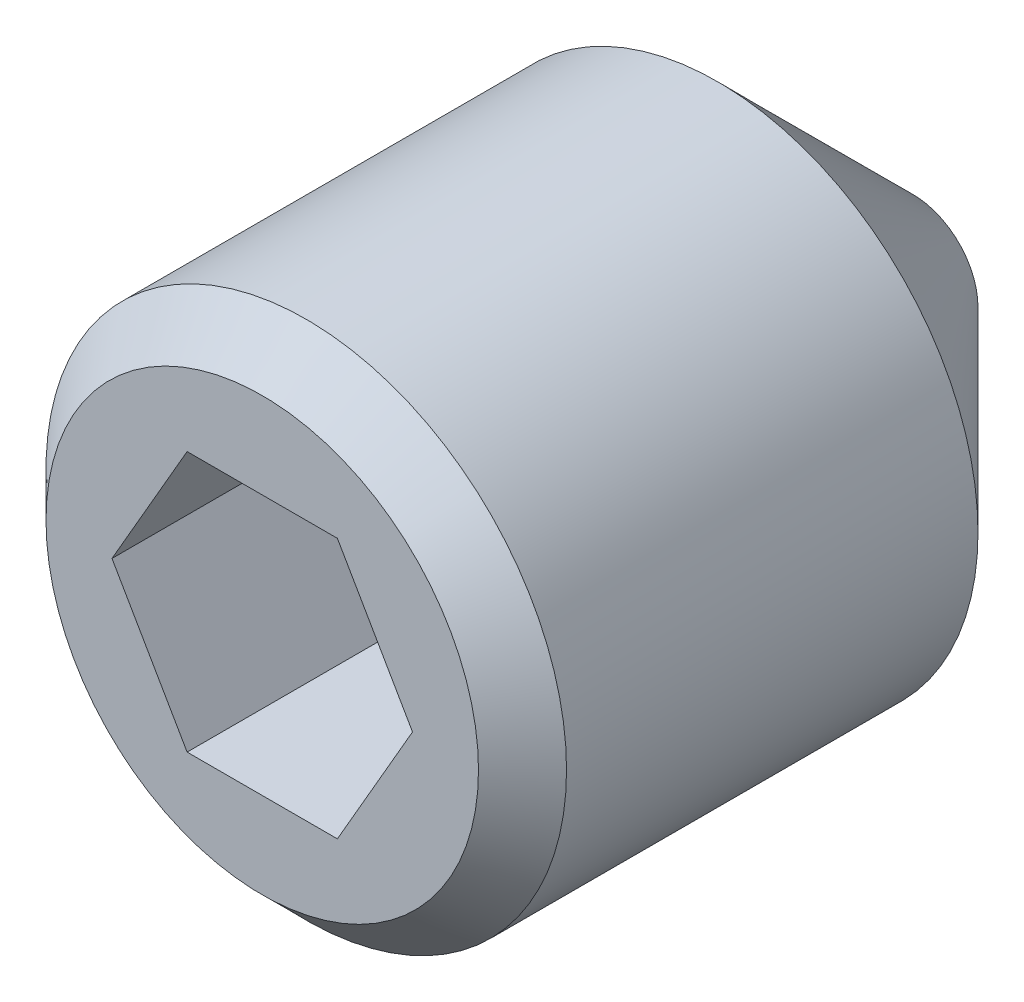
ISO-10303-21;
HEADER;
FILE_DESCRIPTION(('STEP AP214'),'2;1');
FILE_NAME('part.step','',(''),(''),'','','');
FILE_SCHEMA(('AUTOMOTIVE_DESIGN { 1 0 10303 214 1 1 1 1 }'));
ENDSEC;
DATA;
#1=APPLICATION_CONTEXT('core data for automotive mechanical design processes');
#2=APPLICATION_PROTOCOL_DEFINITION('international standard','automotive_design',2000,#1);
#3=PRODUCT_CONTEXT('',#1,'mechanical');
#4=PRODUCT('Part','Part','',(#3));
#5=PRODUCT_RELATED_PRODUCT_CATEGORY('part','',(#4));
#6=PRODUCT_DEFINITION_FORMATION('','',#4);
#7=PRODUCT_DEFINITION_CONTEXT('part definition',#1,'design');
#8=PRODUCT_DEFINITION('design','',#6,#7);
#9=PRODUCT_DEFINITION_SHAPE('','',#8);
#10=(LENGTH_UNIT() NAMED_UNIT(*) SI_UNIT(.MILLI.,.METRE.));
#11=(NAMED_UNIT(*) PLANE_ANGLE_UNIT() SI_UNIT($,.RADIAN.));
#12=(NAMED_UNIT(*) SI_UNIT($,.STERADIAN.) SOLID_ANGLE_UNIT());
#13=UNCERTAINTY_MEASURE_WITH_UNIT(LENGTH_MEASURE(1.E-05),#10,'distance_accuracy_value','');
#14=(GEOMETRIC_REPRESENTATION_CONTEXT(3) GLOBAL_UNCERTAINTY_ASSIGNED_CONTEXT((#13)) GLOBAL_UNIT_ASSIGNED_CONTEXT((#10,
#11,#12)) REPRESENTATION_CONTEXT('',''));
#15=CARTESIAN_POINT('',(0.,0.,0.));
#16=DIRECTION('',(0.,0.,1.));
#17=DIRECTION('',(1.,0.,0.));
#18=AXIS2_PLACEMENT_3D('',#15,#16,#17);
#19=CARTESIAN_POINT('',(0.,3.3234375,0.));
#20=DIRECTION('',(0.,0.,-1.));
#21=DIRECTION('',(-1.,0.,0.));
#22=AXIS2_PLACEMENT_3D('',#19,#20,#21);
#23=PLANE('',#22);
#24=CARTESIAN_POINT('',(0.,0.,0.));
#25=DIRECTION('',(0.,0.,1.));
#26=DIRECTION('',(1.,0.,0.));
#27=AXIS2_PLACEMENT_3D('',#24,#25,#26);
#28=CIRCLE('',#27,3.3234375);
#29=CARTESIAN_POINT('',(3.3234375,0.,0.));
#30=VERTEX_POINT('',#29);
#31=EDGE_CURVE('E106',#30,#30,#28,.T.);
#32=ORIENTED_EDGE('',*,*,#31,.T.);
#33=EDGE_LOOP('',(#32));
#34=FACE_BOUND('',#33,.T.);
#35=DIRECTION('',(0.5,-0.866025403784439,0.));
#36=VECTOR('',#35,1.);
#37=CARTESIAN_POINT('',(1.1547,1.99999906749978,0.));
#38=LINE('',#37,#36);
#39=CARTESIAN_POINT('',(1.1547,1.99999906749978,0.));
#40=VERTEX_POINT('',#39);
#41=CARTESIAN_POINT('',(2.3094,0.,0.));
#42=VERTEX_POINT('',#41);
#43=EDGE_CURVE('E30',#40,#42,#38,.T.);
#44=ORIENTED_EDGE('',*,*,#43,.T.);
#45=DIRECTION('',(-0.5,-0.866025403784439,0.));
#46=VECTOR('',#45,1.);
#47=CARTESIAN_POINT('',(2.3094,0.,0.));
#48=LINE('',#47,#46);
#49=CARTESIAN_POINT('',(1.1547,-1.99999906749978,0.));
#50=VERTEX_POINT('',#49);
#51=EDGE_CURVE('E154',#42,#50,#48,.T.);
#52=ORIENTED_EDGE('',*,*,#51,.T.);
#53=DIRECTION('',(-1.,0.,0.));
#54=VECTOR('',#53,1.);
#55=CARTESIAN_POINT('',(1.1547,-1.99999906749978,0.));
#56=LINE('',#55,#54);
#57=CARTESIAN_POINT('',(-1.1547,-1.99999906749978,0.));
#58=VERTEX_POINT('',#57);
#59=EDGE_CURVE('E209',#50,#58,#56,.T.);
#60=ORIENTED_EDGE('',*,*,#59,.T.);
#61=DIRECTION('',(-0.5,0.866025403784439,0.));
#62=VECTOR('',#61,1.);
#63=CARTESIAN_POINT('',(-1.1547,-1.99999906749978,0.));
#64=LINE('',#63,#62);
#65=CARTESIAN_POINT('',(-2.3094,0.,0.));
#66=VERTEX_POINT('',#65);
#67=EDGE_CURVE('E207',#58,#66,#64,.T.);
#68=ORIENTED_EDGE('',*,*,#67,.T.);
#69=DIRECTION('',(0.5,0.866025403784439,0.));
#70=VECTOR('',#69,1.);
#71=CARTESIAN_POINT('',(-2.3094,0.,0.));
#72=LINE('',#71,#70);
#73=CARTESIAN_POINT('',(-1.1547,1.99999906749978,0.));
#74=VERTEX_POINT('',#73);
#75=EDGE_CURVE('E95',#66,#74,#72,.T.);
#76=ORIENTED_EDGE('',*,*,#75,.T.);
#77=DIRECTION('',(1.,0.,0.));
#78=VECTOR('',#77,1.);
#79=CARTESIAN_POINT('',(-1.1547,1.99999906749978,0.));
#80=LINE('',#79,#78);
#81=EDGE_CURVE('E91',#74,#40,#80,.T.);
#82=ORIENTED_EDGE('',*,*,#81,.T.);
#83=EDGE_LOOP('',(#44,#52,#60,#68,#76,#82));
#84=FACE_BOUND('',#83,.T.);
#85=ADVANCED_FACE('F16',(#34,#84),#23,.F.);
#86=CARTESIAN_POINT('',(0.,0.,-10.));
#87=DIRECTION('',(0.,0.,1.));
#88=DIRECTION('',(1.,0.,0.));
#89=AXIS2_PLACEMENT_3D('',#86,#87,#88);
#90=PLANE('',#89);
#91=CARTESIAN_POINT('',(0.,0.,-10.));
#92=DIRECTION('',(0.,0.,1.));
#93=DIRECTION('',(1.,0.,0.));
#94=AXIS2_PLACEMENT_3D('',#91,#92,#93);
#95=CIRCLE('',#94,1.);
#96=CARTESIAN_POINT('',(1.,0.,-10.));
#97=VERTEX_POINT('',#96);
#98=EDGE_CURVE('E11',#97,#97,#95,.T.);
#99=ORIENTED_EDGE('',*,*,#98,.F.);
#100=EDGE_LOOP('',(#99));
#101=FACE_BOUND('',#100,.T.);
#102=ADVANCED_FACE('F119',(#101),#90,.F.);
#103=CARTESIAN_POINT('',(0.,0.,-10.));
#104=DIRECTION('',(0.,0.,1.));
#105=DIRECTION('',(1.,0.,0.));
#106=AXIS2_PLACEMENT_3D('',#103,#104,#105);
#107=CONICAL_SURFACE('',#106,1.,0.785398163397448);
#108=CARTESIAN_POINT('',(0.,0.,-7.));
#109=DIRECTION('',(0.,0.,1.));
#110=DIRECTION('',(1.,0.,0.));
#111=AXIS2_PLACEMENT_3D('',#108,#109,#110);
#112=CIRCLE('',#111,4.);
#113=CARTESIAN_POINT('',(4.,0.,-7.));
#114=VERTEX_POINT('',#113);
#115=EDGE_CURVE('E23',#114,#114,#112,.T.);
#116=CARTESIAN_POINT('',(4.,0.,-7.));
#117=CARTESIAN_POINT('',(3.96875,0.,-7.03125));
#118=CARTESIAN_POINT('',(3.9375,0.,-7.0625));
#119=CARTESIAN_POINT('',(3.875,0.,-7.125));
#120=CARTESIAN_POINT('',(3.84375,0.,-7.15625));
#121=CARTESIAN_POINT('',(3.78125,0.,-7.21875));
#122=CARTESIAN_POINT('',(3.75,0.,-7.25));
#123=CARTESIAN_POINT('',(3.6875,0.,-7.3125));
#124=CARTESIAN_POINT('',(3.65625,0.,-7.34375));
#125=CARTESIAN_POINT('',(3.59375,0.,-7.40625));
#126=CARTESIAN_POINT('',(3.5625,0.,-7.4375));
#127=CARTESIAN_POINT('',(3.5,0.,-7.5));
#128=CARTESIAN_POINT('',(3.46875,0.,-7.53125));
#129=CARTESIAN_POINT('',(3.40625,0.,-7.59375));
#130=CARTESIAN_POINT('',(3.375,0.,-7.625));
#131=CARTESIAN_POINT('',(3.3125,0.,-7.6875));
#132=CARTESIAN_POINT('',(3.28125,0.,-7.71875));
#133=CARTESIAN_POINT('',(3.21875,0.,-7.78125));
#134=CARTESIAN_POINT('',(3.1875,0.,-7.8125));
#135=CARTESIAN_POINT('',(3.125,0.,-7.875));
#136=CARTESIAN_POINT('',(3.09375,0.,-7.90625));
#137=CARTESIAN_POINT('',(3.03125,0.,-7.96875));
#138=CARTESIAN_POINT('',(3.,0.,-8.));
#139=CARTESIAN_POINT('',(2.9375,0.,-8.0625));
#140=CARTESIAN_POINT('',(2.90625,0.,-8.09375));
#141=CARTESIAN_POINT('',(2.84375,0.,-8.15625));
#142=CARTESIAN_POINT('',(2.8125,0.,-8.1875));
#143=CARTESIAN_POINT('',(2.75,0.,-8.25));
#144=CARTESIAN_POINT('',(2.71875,0.,-8.28125));
#145=CARTESIAN_POINT('',(2.65625,0.,-8.34375));
#146=CARTESIAN_POINT('',(2.625,0.,-8.375));
#147=CARTESIAN_POINT('',(2.5625,0.,-8.4375));
#148=CARTESIAN_POINT('',(2.53125,0.,-8.46875));
#149=CARTESIAN_POINT('',(2.46875,0.,-8.53125));
#150=CARTESIAN_POINT('',(2.4375,0.,-8.5625));
#151=CARTESIAN_POINT('',(2.375,0.,-8.625));
#152=CARTESIAN_POINT('',(2.34375,0.,-8.65625));
#153=CARTESIAN_POINT('',(2.28125,0.,-8.71875));
#154=CARTESIAN_POINT('',(2.25,0.,-8.75));
#155=CARTESIAN_POINT('',(2.1875,0.,-8.8125));
#156=CARTESIAN_POINT('',(2.15625,0.,-8.84375));
#157=CARTESIAN_POINT('',(2.09375,0.,-8.90625));
#158=CARTESIAN_POINT('',(2.0625,0.,-8.9375));
#159=CARTESIAN_POINT('',(2.,0.,-9.));
#160=CARTESIAN_POINT('',(1.96875,0.,-9.03125));
#161=CARTESIAN_POINT('',(1.90625,0.,-9.09375));
#162=CARTESIAN_POINT('',(1.875,0.,-9.125));
#163=CARTESIAN_POINT('',(1.8125,0.,-9.1875));
#164=CARTESIAN_POINT('',(1.78125,0.,-9.21875));
#165=CARTESIAN_POINT('',(1.71875,0.,-9.28125));
#166=CARTESIAN_POINT('',(1.6875,0.,-9.3125));
#167=CARTESIAN_POINT('',(1.625,0.,-9.375));
#168=CARTESIAN_POINT('',(1.59375,0.,-9.40625));
#169=CARTESIAN_POINT('',(1.53125,0.,-9.46875));
#170=CARTESIAN_POINT('',(1.5,0.,-9.5));
#171=CARTESIAN_POINT('',(1.4375,0.,-9.5625));
#172=CARTESIAN_POINT('',(1.40625,0.,-9.59375));
#173=CARTESIAN_POINT('',(1.34375,0.,-9.65625));
#174=CARTESIAN_POINT('',(1.3125,0.,-9.6875));
#175=CARTESIAN_POINT('',(1.25,0.,-9.75));
#176=CARTESIAN_POINT('',(1.21875,0.,-9.78125));
#177=CARTESIAN_POINT('',(1.15625,0.,-9.84375));
#178=CARTESIAN_POINT('',(1.125,0.,-9.875));
#179=CARTESIAN_POINT('',(1.0625,0.,-9.9375));
#180=CARTESIAN_POINT('',(1.03125,0.,-9.96875));
#181=CARTESIAN_POINT('',(1.,0.,-10.));
#182=B_SPLINE_CURVE_WITH_KNOTS('',3,(#116,#117,#118,#119,#120,#121,#122,#123,#124,#125,#126,
#127,#128,#129,#130,#131,#132,#133,#134,#135,#136,#137,#138,#139,#140,#141,#142,#143,#144,#145,
#146,#147,#148,#149,#150,#151,#152,#153,#154,#155,#156,#157,#158,#159,#160,#161,#162,#163,#164,
#165,#166,#167,#168,#169,#170,#171,#172,#173,#174,#175,#176,#177,#178,#179,#180,#181),
.UNSPECIFIED.,.F.,.F.,(4,2,2,2,2,2,2,2,2,2,2,2,2,2,2,2,2,2,2,2,2,2,2,2,2,2,2,2,2,2,2,2,4),(0.,
0.132582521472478,0.265165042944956,0.397747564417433,0.53033008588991,0.662912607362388,
0.795495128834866,0.928077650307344,1.06066017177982,1.1932426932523,1.32582521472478,
1.45840773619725,1.59099025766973,1.72357277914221,1.85615530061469,1.98873782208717,
2.12132034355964,2.25390286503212,2.3864853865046,2.51906790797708,2.65165042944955,
2.78423295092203,2.91681547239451,3.04939799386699,3.18198051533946,3.31456303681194,
3.44714555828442,3.5797280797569,3.71231060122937,3.84489312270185,3.97747564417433,
4.11005816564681,4.24264068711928),.UNSPECIFIED.);
#183=EDGE_CURVE('BSEAM116',#114,#97,#182,.T.);
#184=ORIENTED_EDGE('',*,*,#115,.F.);
#185=ORIENTED_EDGE('',*,*,#98,.T.);
#186=ORIENTED_EDGE('',*,*,#183,.T.);
#187=ORIENTED_EDGE('',*,*,#183,.F.);
#188=EDGE_LOOP('',(#184,#186,#185,#187));
#189=FACE_BOUND('',#188,.T.);
#190=ADVANCED_FACE('F116',(#189),#107,.T.);
#191=CARTESIAN_POINT('',(0.,0.,0.));
#192=DIRECTION('',(0.,0.,1.));
#193=DIRECTION('',(1.,0.,0.));
#194=AXIS2_PLACEMENT_3D('',#191,#192,#193);
#195=CYLINDRICAL_SURFACE('',#194,4.);
#196=CARTESIAN_POINT('',(0.,0.,-0.6765625));
#197=DIRECTION('',(0.,0.,1.));
#198=DIRECTION('',(1.,0.,0.));
#199=AXIS2_PLACEMENT_3D('',#196,#197,#198);
#200=CIRCLE('',#199,4.);
#201=CARTESIAN_POINT('',(4.,0.,-0.6765625));
#202=VERTEX_POINT('',#201);
#203=EDGE_CURVE('E109',#202,#202,#200,.T.);
#204=ORIENTED_EDGE('',*,*,#203,.F.);
#205=EDGE_LOOP('',(#204));
#206=FACE_BOUND('',#205,.T.);
#207=ORIENTED_EDGE('',*,*,#115,.T.);
#208=EDGE_LOOP('',(#207));
#209=FACE_BOUND('',#208,.T.);
#210=ADVANCED_FACE('F114',(#206,#209),#195,.T.);
#211=CARTESIAN_POINT('',(0.,0.,-0.6765625));
#212=DIRECTION('',(0.,0.,-1.));
#213=DIRECTION('',(-1.,0.,0.));
#214=AXIS2_PLACEMENT_3D('',#211,#212,#213);
#215=CONICAL_SURFACE('',#214,4.,0.785398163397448);
#216=ORIENTED_EDGE('',*,*,#31,.F.);
#217=EDGE_LOOP('',(#216));
#218=FACE_BOUND('',#217,.T.);
#219=ORIENTED_EDGE('',*,*,#203,.T.);
#220=EDGE_LOOP('',(#219));
#221=FACE_BOUND('',#220,.T.);
#222=ADVANCED_FACE('F132',(#218,#221),#215,.T.);
#223=CARTESIAN_POINT('',(1.1547,1.99999906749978,-6.33333271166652));
#224=DIRECTION('',(-0.866025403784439,-0.5,0.));
#225=DIRECTION('',(-0.5,0.866025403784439,0.));
#226=AXIS2_PLACEMENT_3D('',#223,#224,#225);
#227=PLANE('',#226);
#228=DIRECTION('',(0.,0.,1.));
#229=VECTOR('',#228,1.);
#230=CARTESIAN_POINT('',(2.3094,0.,-6.33333271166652));
#231=LINE('',#230,#229);
#232=CARTESIAN_POINT('',(2.3094,0.,-5.));
#233=VERTEX_POINT('',#232);
#234=EDGE_CURVE('E104',#233,#42,#231,.T.);
#235=ORIENTED_EDGE('',*,*,#234,.T.);
#236=ORIENTED_EDGE('',*,*,#43,.F.);
#237=DIRECTION('',(0.,0.,1.));
#238=VECTOR('',#237,1.);
#239=CARTESIAN_POINT('',(1.1547,1.99999906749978,-6.33333271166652));
#240=LINE('',#239,#238);
#241=CARTESIAN_POINT('',(1.1547,1.99999906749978,-5.));
#242=VERTEX_POINT('',#241);
#243=EDGE_CURVE('E85',#242,#40,#240,.T.);
#244=ORIENTED_EDGE('',*,*,#243,.F.);
#245=CARTESIAN_POINT('',(2.30940011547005,-2.00000000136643E-07,-4.99999993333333));
#246=CARTESIAN_POINT('',(2.25865804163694,0.0878876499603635,-5.02930438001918));
#247=CARTESIAN_POINT('',(2.20747796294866,0.176534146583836,-5.05595524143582));
#248=CARTESIAN_POINT('',(2.10423165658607,0.355361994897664,-5.10247352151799));
#249=CARTESIAN_POINT('',(2.0521635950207,0.445546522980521,-5.12232448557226));
#250=CARTESIAN_POINT('',(1.94867272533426,0.624797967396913,-5.15322394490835));
#251=CARTESIAN_POINT('',(1.89726583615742,0.713837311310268,-5.16447811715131));
#252=CARTESIAN_POINT('',(1.79421029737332,0.892334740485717,-5.17791074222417));
#253=CARTESIAN_POINT('',(1.74256202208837,0.981792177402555,-5.18010032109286));
#254=CARTESIAN_POINT('',(1.64606274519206,1.14893382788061,-5.17553363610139));
#255=CARTESIAN_POINT('',(1.60119726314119,1.2266431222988,-5.16989864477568));
#256=CARTESIAN_POINT('',(1.51175858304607,1.38155546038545,-5.15204263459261));
#257=CARTESIAN_POINT('',(1.46718569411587,1.45875796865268,-5.13981552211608));
#258=CARTESIAN_POINT('',(1.37756276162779,1.61398944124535,-5.10925010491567));
#259=CARTESIAN_POINT('',(1.3325240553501,1.69199876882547,-5.09078229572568));
#260=CARTESIAN_POINT('',(1.2431182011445,1.84685425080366,-5.04886817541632));
#261=CARTESIAN_POINT('',(1.19874990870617,1.92370238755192,-5.02543170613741));
#262=CARTESIAN_POINT('',(1.15469988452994,1.99999926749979,-4.99999993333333));
#263=B_SPLINE_CURVE_WITH_KNOTS('',3,(#245,#246,#247,#248,#249,#250,#251,#252,#253,#254,#255,
#256,#257,#258,#259,#260,#261,#262),.UNSPECIFIED.,.F.,.F.,(4,2,2,2,2,2,2,2,4),(0.,
0.317015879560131,0.634793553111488,0.944707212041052,1.25424036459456,1.52370723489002,
1.79342362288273,2.06912103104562,2.3442773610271),.UNSPECIFIED.);
#264=EDGE_CURVE('E78',#233,#242,#263,.T.);
#265=ORIENTED_EDGE('',*,*,#264,.F.);
#266=EDGE_LOOP('',(#235,#236,#244,#265));
#267=FACE_BOUND('',#266,.T.);
#268=ADVANCED_FACE('F86',(#267),#227,.T.);
#269=CARTESIAN_POINT('',(2.3094,0.,-6.33333271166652));
#270=DIRECTION('',(-0.866025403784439,0.5,0.));
#271=DIRECTION('',(0.5,0.866025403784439,0.));
#272=AXIS2_PLACEMENT_3D('',#269,#270,#271);
#273=PLANE('',#272);
#274=DIRECTION('',(0.,0.,1.));
#275=VECTOR('',#274,1.);
#276=CARTESIAN_POINT('',(1.1547,-1.99999906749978,-6.33333271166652));
#277=LINE('',#276,#275);
#278=CARTESIAN_POINT('',(1.1547,-1.99999906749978,-5.));
#279=VERTEX_POINT('',#278);
#280=EDGE_CURVE('E102',#279,#50,#277,.T.);
#281=ORIENTED_EDGE('',*,*,#280,.T.);
#282=ORIENTED_EDGE('',*,*,#51,.F.);
#283=ORIENTED_EDGE('',*,*,#234,.F.);
#284=CARTESIAN_POINT('',(1.15469988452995,-1.99999926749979,-4.99999993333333));
#285=CARTESIAN_POINT('',(1.20544195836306,-1.91211141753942,-5.02930438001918));
#286=CARTESIAN_POINT('',(1.25662203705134,-1.82346492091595,-5.05595524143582));
#287=CARTESIAN_POINT('',(1.35986834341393,-1.64463707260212,-5.10247352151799));
#288=CARTESIAN_POINT('',(1.41193640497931,-1.55445254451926,-5.12232448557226));
#289=CARTESIAN_POINT('',(1.51542727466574,-1.37520110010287,-5.15322394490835));
#290=CARTESIAN_POINT('',(1.56683416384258,-1.28616175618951,-5.16447811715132));
#291=CARTESIAN_POINT('',(1.66988970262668,-1.10766432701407,-5.17791074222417));
#292=CARTESIAN_POINT('',(1.72153797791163,-1.01820689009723,-5.18010032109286));
#293=CARTESIAN_POINT('',(1.81803725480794,-0.851065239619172,-5.17553363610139));
#294=CARTESIAN_POINT('',(1.86290273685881,-0.773355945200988,-5.16989864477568));
#295=CARTESIAN_POINT('',(1.95234141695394,-0.618443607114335,-5.15204263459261));
#296=CARTESIAN_POINT('',(1.99691430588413,-0.541241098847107,-5.13981552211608));
#297=CARTESIAN_POINT('',(2.08653723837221,-0.386009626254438,-5.10925010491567));
#298=CARTESIAN_POINT('',(2.1315759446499,-0.308000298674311,-5.09078229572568));
#299=CARTESIAN_POINT('',(2.2209817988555,-0.153144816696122,-5.04886817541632));
#300=CARTESIAN_POINT('',(2.26535009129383,-0.0762966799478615,-5.02543170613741));
#301=CARTESIAN_POINT('',(2.30940011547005,1.9999999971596E-07,-4.99999993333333));
#302=B_SPLINE_CURVE_WITH_KNOTS('',3,(#284,#285,#286,#287,#288,#289,#290,#291,#292,#293,#294,
#295,#296,#297,#298,#299,#300,#301),.UNSPECIFIED.,.F.,.F.,(4,2,2,2,2,2,2,2,4),(0.,
0.317015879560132,0.634793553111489,0.944707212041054,1.25424036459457,1.52370723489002,
1.79342362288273,2.06912103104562,2.3442773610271),.UNSPECIFIED.);
#303=EDGE_CURVE('E82',#279,#233,#302,.T.);
#304=ORIENTED_EDGE('',*,*,#303,.F.);
#305=EDGE_LOOP('',(#281,#282,#283,#304));
#306=FACE_BOUND('',#305,.T.);
#307=ADVANCED_FACE('F140',(#306),#273,.T.);
#308=CARTESIAN_POINT('',(1.1547,-1.99999906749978,-6.33333271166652));
#309=DIRECTION('',(0.,1.,0.));
#310=DIRECTION('',(1.,0.,0.));
#311=AXIS2_PLACEMENT_3D('',#308,#309,#310);
#312=PLANE('',#311);
#313=DIRECTION('',(0.,0.,1.));
#314=VECTOR('',#313,1.);
#315=CARTESIAN_POINT('',(-1.1547,-1.99999906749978,-6.33333271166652));
#316=LINE('',#315,#314);
#317=CARTESIAN_POINT('',(-1.1547,-1.99999906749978,-5.));
#318=VERTEX_POINT('',#317);
#319=EDGE_CURVE('E100',#318,#58,#316,.T.);
#320=ORIENTED_EDGE('',*,*,#319,.T.);
#321=ORIENTED_EDGE('',*,*,#59,.F.);
#322=ORIENTED_EDGE('',*,*,#280,.F.);
#323=CARTESIAN_POINT('',(-2.99028884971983,-1.99999906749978,-4.25632976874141));
#324=CARTESIAN_POINT('',(-2.90392200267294,-1.99999906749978,-4.29776531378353));
#325=CARTESIAN_POINT('',(-2.81734475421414,-1.99999906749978,-4.33877047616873));
#326=CARTESIAN_POINT('',(-2.64365731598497,-1.99999906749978,-4.41967588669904));
#327=CARTESIAN_POINT('',(-2.5565470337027,-1.99999906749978,-4.45957593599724));
#328=CARTESIAN_POINT('',(-2.38118192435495,-1.99999906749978,-4.53824987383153));
#329=CARTESIAN_POINT('',(-2.29292335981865,-1.99999906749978,-4.57701546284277));
#330=CARTESIAN_POINT('',(-2.11566562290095,-1.99999906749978,-4.65280829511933));
#331=CARTESIAN_POINT('',(-2.02666648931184,-1.99999906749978,-4.68983562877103));
#332=CARTESIAN_POINT('',(-1.84544164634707,-1.99999906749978,-4.76263193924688));
#333=CARTESIAN_POINT('',(-1.75319241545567,-1.99999906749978,-4.79834270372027));
#334=CARTESIAN_POINT('',(-1.56757813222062,-1.99999906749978,-4.86679521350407));
#335=CARTESIAN_POINT('',(-1.47421295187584,-1.99999906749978,-4.89953661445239));
#336=CARTESIAN_POINT('',(-1.28643386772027,-1.99999906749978,-4.96111408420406));
#337=CARTESIAN_POINT('',(-1.19202295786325,-1.99999906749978,-4.98995918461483));
#338=CARTESIAN_POINT('',(-1.00184812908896,-1.99999906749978,-5.04275765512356));
#339=CARTESIAN_POINT('',(-0.906084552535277,-1.99999906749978,-5.06671224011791));
#340=CARTESIAN_POINT('',(-0.713403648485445,-1.99999906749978,-5.10845249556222));
#341=CARTESIAN_POINT('',(-0.616489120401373,-1.99999906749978,-5.12625083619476));
#342=CARTESIAN_POINT('',(-0.421576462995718,-1.99999906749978,-5.15451397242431));
#343=CARTESIAN_POINT('',(-0.323578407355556,-1.99999906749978,-5.16497926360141));
#344=CARTESIAN_POINT('',(-0.12821235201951,-1.99999906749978,-5.17760223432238));
#345=CARTESIAN_POINT('',(-0.0308508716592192,-1.99999906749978,-5.17985794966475));
#346=CARTESIAN_POINT('',(0.163710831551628,-1.99999906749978,-5.17613391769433));
#347=CARTESIAN_POINT('',(0.260911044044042,-1.99999906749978,-5.17015366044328));
#348=CARTESIAN_POINT('',(0.500738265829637,-1.99999906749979,-5.14576313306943));
#349=CARTESIAN_POINT('',(0.642900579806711,-1.99999906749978,-5.12278195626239));
#350=CARTESIAN_POINT('',(0.924460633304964,-1.99999906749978,-5.06352019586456));
#351=CARTESIAN_POINT('',(1.06385482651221,-1.99999906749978,-5.02722358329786));
#352=CARTESIAN_POINT('',(1.27233418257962,-1.99999906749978,-4.96522008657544));
#353=CARTESIAN_POINT('',(1.3424969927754,-1.99999906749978,-4.94300330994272));
#354=CARTESIAN_POINT('',(1.4820922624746,-1.99999906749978,-4.89651457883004));
#355=CARTESIAN_POINT('',(1.55152514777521,-1.99999906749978,-4.87224390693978));
#356=CARTESIAN_POINT('',(1.68975335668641,-1.99999906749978,-4.82199986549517));
#357=CARTESIAN_POINT('',(1.75854879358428,-1.99999906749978,-4.7960268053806));
#358=CARTESIAN_POINT('',(1.8955975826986,-1.99999906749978,-4.74265892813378));
#359=CARTESIAN_POINT('',(1.96385084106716,-1.99999906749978,-4.71526387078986));
#360=CARTESIAN_POINT('',(2.13806939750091,-1.99999906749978,-4.6435822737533));
#361=CARTESIAN_POINT('',(2.24368634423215,-1.99999906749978,-4.59844998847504));
#362=CARTESIAN_POINT('',(2.45396648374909,-1.99999906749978,-4.50600978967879));
#363=CARTESIAN_POINT('',(2.55862960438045,-1.99999906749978,-4.45870171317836));
#364=CARTESIAN_POINT('',(2.87150603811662,-1.99999906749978,-4.31428078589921));
#365=CARTESIAN_POINT('',(3.07857147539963,-1.99999906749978,-4.21468604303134));
#366=CARTESIAN_POINT('',(3.49093332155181,-1.99999906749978,-4.0113195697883));
#367=CARTESIAN_POINT('',(3.6962272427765,-1.99999906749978,-3.90754285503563));
#368=CARTESIAN_POINT('',(4.10540852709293,-1.99999906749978,-3.69732098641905));
#369=CARTESIAN_POINT('',(4.30929606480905,-1.99999906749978,-3.59087617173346));
#370=CARTESIAN_POINT('',(4.69689950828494,-1.99999906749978,-3.38628204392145));
#371=CARTESIAN_POINT('',(4.8807029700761,-1.99999906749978,-3.28829803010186));
#372=CARTESIAN_POINT('',(5.24771864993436,-1.99999906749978,-3.09121356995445));
#373=CARTESIAN_POINT('',(5.43093084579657,-1.99999906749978,-2.99211308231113));
#374=CARTESIAN_POINT('',(5.79643429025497,-1.99999906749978,-2.79332878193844));
#375=CARTESIAN_POINT('',(5.97872669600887,-1.99999906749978,-2.69364709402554));
#376=CARTESIAN_POINT('',(6.34294295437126,-1.99999906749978,-2.49363493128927));
#377=CARTESIAN_POINT('',(6.52486682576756,-1.99999906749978,-2.39330449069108));
#378=CARTESIAN_POINT('',(6.70665829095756,-1.99999906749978,-2.29273615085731));
#379=B_SPLINE_CURVE_WITH_KNOTS('',3,(#323,#324,#325,#326,#327,#328,#329,#330,#331,#332,#333,
#334,#335,#336,#337,#338,#339,#340,#341,#342,#343,#344,#345,#346,#347,#348,#349,#350,#351,#352,
#353,#354,#355,#356,#357,#358,#359,#360,#361,#362,#363,#364,#365,#366,#367,#368,#369,#370,#371,
#372,#373,#374,#375,#376,#377,#378),.UNSPECIFIED.,.F.,.F.,(4,2,2,2,2,2,2,2,2,2,2,2,2,2,2,2,2,2,
2,2,2,2,2,2,2,2,2,4),(0.,0.287380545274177,0.574812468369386,0.86398796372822,1.15314840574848,
1.44986914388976,1.746624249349,2.04267922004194,2.33866055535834,2.63402905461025,
2.92937759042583,3.22118738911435,3.51301525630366,3.94415234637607,4.37581014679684,
4.59657452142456,4.81720203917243,5.03778956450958,5.25841447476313,5.60294644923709,
5.94750427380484,6.63673372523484,7.32681046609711,8.01679992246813,8.64166451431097,
9.26655230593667,9.88985069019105,10.5131164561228),.UNSPECIFIED.);
#380=EDGE_CURVE('E182',#318,#279,#379,.T.);
#381=ORIENTED_EDGE('',*,*,#380,.F.);
#382=EDGE_LOOP('',(#320,#321,#322,#381));
#383=FACE_BOUND('',#382,.T.);
#384=ADVANCED_FACE('F187',(#383),#312,.T.);
#385=CARTESIAN_POINT('',(-1.1547,-1.99999906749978,-6.33333271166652));
#386=DIRECTION('',(0.866025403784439,0.5,0.));
#387=DIRECTION('',(0.5,-0.866025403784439,0.));
#388=AXIS2_PLACEMENT_3D('',#385,#386,#387);
#389=PLANE('',#388);
#390=DIRECTION('',(0.,0.,1.));
#391=VECTOR('',#390,1.);
#392=CARTESIAN_POINT('',(-2.3094,0.,-6.33333271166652));
#393=LINE('',#392,#391);
#394=CARTESIAN_POINT('',(-2.3094,0.,-5.));
#395=VERTEX_POINT('',#394);
#396=EDGE_CURVE('E93',#395,#66,#393,.T.);
#397=ORIENTED_EDGE('',*,*,#396,.T.);
#398=ORIENTED_EDGE('',*,*,#67,.F.);
#399=ORIENTED_EDGE('',*,*,#319,.F.);
#400=CARTESIAN_POINT('',(-2.30940011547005,2.00000000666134E-07,-4.99999993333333));
#401=CARTESIAN_POINT('',(-2.25865804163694,-0.0878876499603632,-5.02930438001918));
#402=CARTESIAN_POINT('',(-2.20747796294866,-0.176534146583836,-5.05595524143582));
#403=CARTESIAN_POINT('',(-2.10423165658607,-0.355361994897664,-5.10247352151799));
#404=CARTESIAN_POINT('',(-2.0521635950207,-0.445546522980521,-5.12232448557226));
#405=CARTESIAN_POINT('',(-1.94867272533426,-0.624797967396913,-5.15322394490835));
#406=CARTESIAN_POINT('',(-1.89726583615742,-0.713837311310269,-5.16447811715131));
#407=CARTESIAN_POINT('',(-1.79421029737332,-0.892334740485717,-5.17791074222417));
#408=CARTESIAN_POINT('',(-1.74256202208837,-0.981792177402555,-5.18010032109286));
#409=CARTESIAN_POINT('',(-1.64606274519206,-1.14893382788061,-5.17553363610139));
#410=CARTESIAN_POINT('',(-1.60119726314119,-1.22664312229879,-5.16989864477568));
#411=CARTESIAN_POINT('',(-1.51175858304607,-1.38155546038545,-5.15204263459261));
#412=CARTESIAN_POINT('',(-1.46718569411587,-1.45875796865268,-5.13981552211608));
#413=CARTESIAN_POINT('',(-1.37756276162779,-1.61398944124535,-5.10925010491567));
#414=CARTESIAN_POINT('',(-1.3325240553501,-1.69199876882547,-5.09078229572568));
#415=CARTESIAN_POINT('',(-1.2431182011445,-1.84685425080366,-5.04886817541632));
#416=CARTESIAN_POINT('',(-1.19874990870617,-1.92370238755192,-5.02543170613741));
#417=CARTESIAN_POINT('',(-1.15469988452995,-1.99999926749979,-4.99999993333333));
#418=B_SPLINE_CURVE_WITH_KNOTS('',3,(#400,#401,#402,#403,#404,#405,#406,#407,#408,#409,#410,
#411,#412,#413,#414,#415,#416,#417),.UNSPECIFIED.,.F.,.F.,(4,2,2,2,2,2,2,2,4),(0.,
0.317015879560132,0.634793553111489,0.944707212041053,1.25424036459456,1.52370723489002,
1.79342362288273,2.06912103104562,2.3442773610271),.UNSPECIFIED.);
#419=EDGE_CURVE('E176',#395,#318,#418,.T.);
#420=ORIENTED_EDGE('',*,*,#419,.F.);
#421=EDGE_LOOP('',(#397,#398,#399,#420));
#422=FACE_BOUND('',#421,.T.);
#423=ADVANCED_FACE('F190',(#422),#389,.T.);
#424=CARTESIAN_POINT('',(-2.3094,0.,-6.33333271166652));
#425=DIRECTION('',(0.866025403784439,-0.5,0.));
#426=DIRECTION('',(-0.5,-0.866025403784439,0.));
#427=AXIS2_PLACEMENT_3D('',#424,#425,#426);
#428=PLANE('',#427);
#429=DIRECTION('',(0.,0.,1.));
#430=VECTOR('',#429,1.);
#431=CARTESIAN_POINT('',(-1.1547,1.99999906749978,-6.33333271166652));
#432=LINE('',#431,#430);
#433=CARTESIAN_POINT('',(-1.1547,1.99999906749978,-5.));
#434=VERTEX_POINT('',#433);
#435=EDGE_CURVE('E90',#434,#74,#432,.T.);
#436=ORIENTED_EDGE('',*,*,#435,.T.);
#437=ORIENTED_EDGE('',*,*,#75,.F.);
#438=ORIENTED_EDGE('',*,*,#396,.F.);
#439=CARTESIAN_POINT('',(-1.15469988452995,1.99999926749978,-4.99999993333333));
#440=CARTESIAN_POINT('',(-1.20544195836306,1.91211141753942,-5.02930438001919));
#441=CARTESIAN_POINT('',(-1.25662203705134,1.82346492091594,-5.05595524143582));
#442=CARTESIAN_POINT('',(-1.35986834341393,1.64463707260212,-5.10247352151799));
#443=CARTESIAN_POINT('',(-1.41193640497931,1.55445254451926,-5.12232448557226));
#444=CARTESIAN_POINT('',(-1.51542727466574,1.37520110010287,-5.15322394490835));
#445=CARTESIAN_POINT('',(-1.56683416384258,1.28616175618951,-5.16447811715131));
#446=CARTESIAN_POINT('',(-1.66988970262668,1.10766432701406,-5.17791074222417));
#447=CARTESIAN_POINT('',(-1.72153797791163,1.01820689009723,-5.18010032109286));
#448=CARTESIAN_POINT('',(-1.81803725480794,0.851065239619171,-5.17553363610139));
#449=CARTESIAN_POINT('',(-1.86290273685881,0.773355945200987,-5.16989864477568));
#450=CARTESIAN_POINT('',(-1.95234141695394,0.618443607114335,-5.15204263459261));
#451=CARTESIAN_POINT('',(-1.99691430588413,0.541241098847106,-5.13981552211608));
#452=CARTESIAN_POINT('',(-2.08653723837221,0.386009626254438,-5.10925010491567));
#453=CARTESIAN_POINT('',(-2.1315759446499,0.308000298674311,-5.09078229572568));
#454=CARTESIAN_POINT('',(-2.2209817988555,0.153144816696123,-5.04886817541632));
#455=CARTESIAN_POINT('',(-2.26535009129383,0.0762966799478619,-5.02543170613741));
#456=CARTESIAN_POINT('',(-2.30940011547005,-1.99999999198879E-07,-4.99999993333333));
#457=B_SPLINE_CURVE_WITH_KNOTS('',3,(#439,#440,#441,#442,#443,#444,#445,#446,#447,#448,#449,
#450,#451,#452,#453,#454,#455,#456),.UNSPECIFIED.,.F.,.F.,(4,2,2,2,2,2,2,2,4),(0.,
0.317015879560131,0.634793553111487,0.944707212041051,1.25424036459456,1.52370723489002,
1.79342362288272,2.06912103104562,2.34427736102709),.UNSPECIFIED.);
#458=EDGE_CURVE('E38',#434,#395,#457,.T.);
#459=ORIENTED_EDGE('',*,*,#458,.F.);
#460=EDGE_LOOP('',(#436,#437,#438,#459));
#461=FACE_BOUND('',#460,.T.);
#462=ADVANCED_FACE('F194',(#461),#428,.T.);
#463=CARTESIAN_POINT('',(-1.1547,1.99999906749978,-6.33333271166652));
#464=DIRECTION('',(0.,-1.,0.));
#465=DIRECTION('',(-1.,0.,0.));
#466=AXIS2_PLACEMENT_3D('',#463,#464,#465);
#467=PLANE('',#466);
#468=ORIENTED_EDGE('',*,*,#243,.T.);
#469=ORIENTED_EDGE('',*,*,#81,.F.);
#470=ORIENTED_EDGE('',*,*,#435,.F.);
#471=CARTESIAN_POINT('',(-2.99028884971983,1.99999906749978,-4.25632976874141));
#472=CARTESIAN_POINT('',(-2.90392200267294,1.99999906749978,-4.29776531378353));
#473=CARTESIAN_POINT('',(-2.81734475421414,1.99999906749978,-4.33877047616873));
#474=CARTESIAN_POINT('',(-2.64365731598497,1.99999906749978,-4.41967588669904));
#475=CARTESIAN_POINT('',(-2.5565470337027,1.99999906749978,-4.45957593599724));
#476=CARTESIAN_POINT('',(-2.38118192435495,1.99999906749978,-4.53824987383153));
#477=CARTESIAN_POINT('',(-2.29292335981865,1.99999906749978,-4.57701546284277));
#478=CARTESIAN_POINT('',(-2.11566562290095,1.99999906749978,-4.65280829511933));
#479=CARTESIAN_POINT('',(-2.02666648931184,1.99999906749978,-4.68983562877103));
#480=CARTESIAN_POINT('',(-1.84544164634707,1.99999906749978,-4.76263193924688));
#481=CARTESIAN_POINT('',(-1.75319241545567,1.99999906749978,-4.79834270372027));
#482=CARTESIAN_POINT('',(-1.56757813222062,1.99999906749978,-4.86679521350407));
#483=CARTESIAN_POINT('',(-1.47421295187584,1.99999906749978,-4.89953661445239));
#484=CARTESIAN_POINT('',(-1.28643386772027,1.99999906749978,-4.96111408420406));
#485=CARTESIAN_POINT('',(-1.19202295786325,1.99999906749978,-4.98995918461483));
#486=CARTESIAN_POINT('',(-1.00184812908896,1.99999906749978,-5.04275765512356));
#487=CARTESIAN_POINT('',(-0.906084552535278,1.99999906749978,-5.06671224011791));
#488=CARTESIAN_POINT('',(-0.713403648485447,1.99999906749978,-5.10845249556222));
#489=CARTESIAN_POINT('',(-0.616489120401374,1.99999906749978,-5.12625083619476));
#490=CARTESIAN_POINT('',(-0.42157646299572,1.99999906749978,-5.15451397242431));
#491=CARTESIAN_POINT('',(-0.323578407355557,1.99999906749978,-5.1649792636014));
#492=CARTESIAN_POINT('',(-0.128212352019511,1.99999906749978,-5.17760223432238));
#493=CARTESIAN_POINT('',(-0.030850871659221,1.99999906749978,-5.17985794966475));
#494=CARTESIAN_POINT('',(0.163710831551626,1.99999906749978,-5.17613391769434));
#495=CARTESIAN_POINT('',(0.26091104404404,1.99999906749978,-5.17015366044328));
#496=CARTESIAN_POINT('',(0.500738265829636,1.99999906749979,-5.14576313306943));
#497=CARTESIAN_POINT('',(0.642900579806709,1.99999906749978,-5.12278195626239));
#498=CARTESIAN_POINT('',(0.924460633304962,1.99999906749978,-5.06352019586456));
#499=CARTESIAN_POINT('',(1.06385482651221,1.99999906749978,-5.02722358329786));
#500=CARTESIAN_POINT('',(1.27233418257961,1.99999906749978,-4.96522008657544));
#501=CARTESIAN_POINT('',(1.3424969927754,1.99999906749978,-4.94300330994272));
#502=CARTESIAN_POINT('',(1.4820922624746,1.99999906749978,-4.89651457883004));
#503=CARTESIAN_POINT('',(1.55152514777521,1.99999906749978,-4.87224390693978));
#504=CARTESIAN_POINT('',(1.68975335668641,1.99999906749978,-4.82199986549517));
#505=CARTESIAN_POINT('',(1.75854879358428,1.99999906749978,-4.79602680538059));
#506=CARTESIAN_POINT('',(1.8955975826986,1.99999906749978,-4.74265892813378));
#507=CARTESIAN_POINT('',(1.96385084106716,1.99999906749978,-4.71526387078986));
#508=CARTESIAN_POINT('',(2.13806939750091,1.99999906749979,-4.6435822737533));
#509=CARTESIAN_POINT('',(2.24368634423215,1.99999906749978,-4.59844998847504));
#510=CARTESIAN_POINT('',(2.45396648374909,1.99999906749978,-4.50600978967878));
#511=CARTESIAN_POINT('',(2.55862960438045,1.99999906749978,-4.45870171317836));
#512=CARTESIAN_POINT('',(2.87150603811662,1.99999906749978,-4.31428078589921));
#513=CARTESIAN_POINT('',(3.07857147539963,1.99999906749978,-4.21468604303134));
#514=CARTESIAN_POINT('',(3.49093332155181,1.99999906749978,-4.0113195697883));
#515=CARTESIAN_POINT('',(3.6962272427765,1.99999906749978,-3.90754285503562));
#516=CARTESIAN_POINT('',(4.10540852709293,1.99999906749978,-3.69732098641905));
#517=CARTESIAN_POINT('',(4.30929606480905,1.99999906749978,-3.59087617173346));
#518=CARTESIAN_POINT('',(4.69689950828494,1.99999906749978,-3.38628204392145));
#519=CARTESIAN_POINT('',(4.8807029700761,1.99999906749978,-3.28829803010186));
#520=CARTESIAN_POINT('',(5.24771864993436,1.99999906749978,-3.09121356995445));
#521=CARTESIAN_POINT('',(5.43093084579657,1.99999906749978,-2.99211308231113));
#522=CARTESIAN_POINT('',(5.79643429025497,1.99999906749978,-2.79332878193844));
#523=CARTESIAN_POINT('',(5.97872669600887,1.99999906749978,-2.69364709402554));
#524=CARTESIAN_POINT('',(6.34294295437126,1.99999906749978,-2.49363493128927));
#525=CARTESIAN_POINT('',(6.52486682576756,1.99999906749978,-2.39330449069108));
#526=CARTESIAN_POINT('',(6.70665829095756,1.99999906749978,-2.29273615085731));
#527=B_SPLINE_CURVE_WITH_KNOTS('',3,(#471,#472,#473,#474,#475,#476,#477,#478,#479,#480,#481,
#482,#483,#484,#485,#486,#487,#488,#489,#490,#491,#492,#493,#494,#495,#496,#497,#498,#499,#500,
#501,#502,#503,#504,#505,#506,#507,#508,#509,#510,#511,#512,#513,#514,#515,#516,#517,#518,#519,
#520,#521,#522,#523,#524,#525,#526),.UNSPECIFIED.,.F.,.F.,(4,2,2,2,2,2,2,2,2,2,2,2,2,2,2,2,2,2,
2,2,2,2,2,2,2,2,2,4),(0.,0.287380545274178,0.574812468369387,0.86398796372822,1.15314840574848,
1.44986914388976,1.746624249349,2.04267922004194,2.33866055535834,2.63402905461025,
2.92937759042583,3.22118738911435,3.51301525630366,3.94415234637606,4.37581014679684,
4.59657452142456,4.81720203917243,5.03778956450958,5.25841447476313,5.60294644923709,
5.94750427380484,6.63673372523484,7.32681046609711,8.01679992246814,8.64166451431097,
9.26655230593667,9.88985069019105,10.5131164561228),.UNSPECIFIED.);
#528=EDGE_CURVE('E79',#242,#434,#527,.F.);
#529=ORIENTED_EDGE('',*,*,#528,.F.);
#530=EDGE_LOOP('',(#468,#469,#470,#529));
#531=FACE_BOUND('',#530,.T.);
#532=ADVANCED_FACE('F74',(#531),#467,.T.);
#533=CARTESIAN_POINT('',(0.,0.,-6.33333271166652));
#534=DIRECTION('',(0.,0.,1.));
#535=DIRECTION('',(1.,0.,0.));
#536=AXIS2_PLACEMENT_3D('',#533,#534,#535);
#537=CONICAL_SURFACE('',#536,0.,1.0471975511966);
#538=CARTESIAN_POINT('',(0.,0.,-6.33333271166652));
#539=VERTEX_POINT('',#538);
#540=VERTEX_LOOP('',#539);
#541=FACE_BOUND('',#540,.T.);
#542=ORIENTED_EDGE('',*,*,#264,.T.);
#543=ORIENTED_EDGE('',*,*,#528,.T.);
#544=ORIENTED_EDGE('',*,*,#458,.T.);
#545=ORIENTED_EDGE('',*,*,#419,.T.);
#546=ORIENTED_EDGE('',*,*,#380,.T.);
#547=ORIENTED_EDGE('',*,*,#303,.T.);
#548=EDGE_LOOP('',(#542,#543,#544,#545,#546,#547));
#549=FACE_BOUND('',#548,.T.);
#550=ADVANCED_FACE('F71',(#541,#549),#537,.F.);
#551=CLOSED_SHELL('',(#85,#102,#190,#210,#222,#268,#307,#384,#423,#462,#532,#550));
#552=MANIFOLD_SOLID_BREP('B1',#551);
#553=ADVANCED_BREP_SHAPE_REPRESENTATION('',(#18,#552),#14);
#554=SHAPE_DEFINITION_REPRESENTATION(#9,#553);
ENDSEC;
END-ISO-10303-21;
